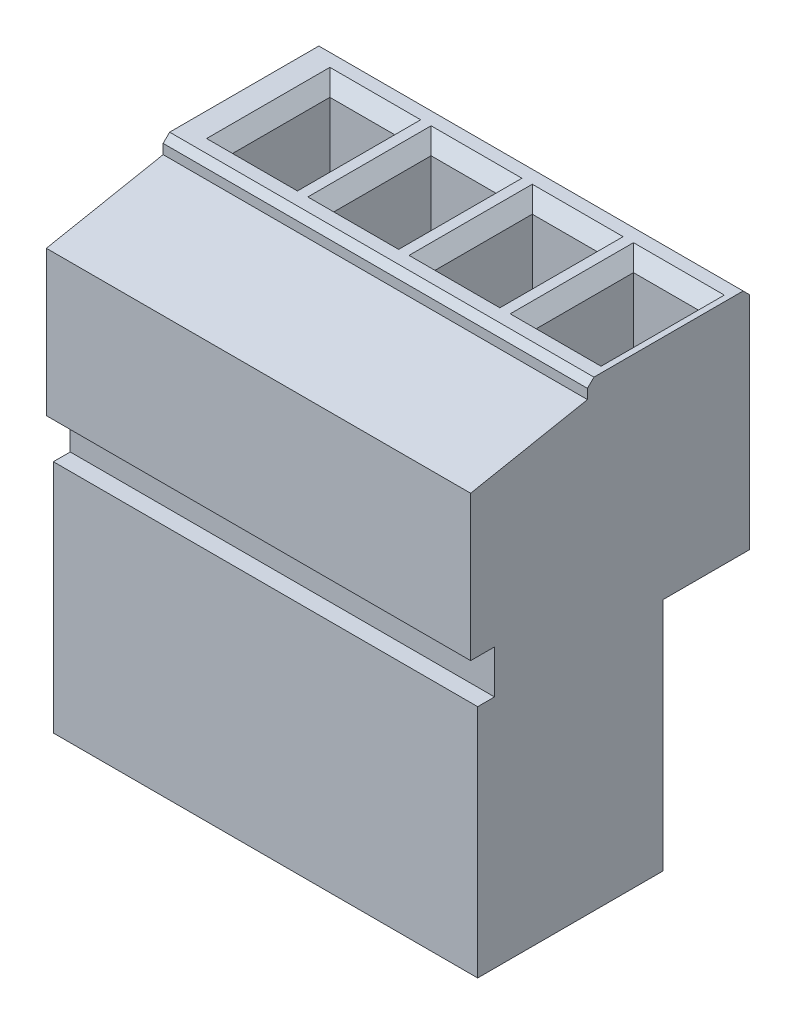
ISO-10303-21;
HEADER;
FILE_DESCRIPTION(('STEP AP214'),'2;1');
FILE_NAME('part.step','',(''),(''),'','','');
FILE_SCHEMA(('AUTOMOTIVE_DESIGN { 1 0 10303 214 1 1 1 1 }'));
ENDSEC;
DATA;
#1=APPLICATION_CONTEXT('core data for automotive mechanical design processes');
#2=APPLICATION_PROTOCOL_DEFINITION('international standard','automotive_design',2000,#1);
#3=PRODUCT_CONTEXT('',#1,'mechanical');
#4=PRODUCT('Part','Part','',(#3));
#5=PRODUCT_RELATED_PRODUCT_CATEGORY('part','',(#4));
#6=PRODUCT_DEFINITION_FORMATION('','',#4);
#7=PRODUCT_DEFINITION_CONTEXT('part definition',#1,'design');
#8=PRODUCT_DEFINITION('design','',#6,#7);
#9=PRODUCT_DEFINITION_SHAPE('','',#8);
#10=(LENGTH_UNIT() NAMED_UNIT(*) SI_UNIT(.MILLI.,.METRE.));
#11=(NAMED_UNIT(*) PLANE_ANGLE_UNIT() SI_UNIT($,.RADIAN.));
#12=(NAMED_UNIT(*) SI_UNIT($,.STERADIAN.) SOLID_ANGLE_UNIT());
#13=UNCERTAINTY_MEASURE_WITH_UNIT(LENGTH_MEASURE(1.E-05),#10,'distance_accuracy_value','');
#14=(GEOMETRIC_REPRESENTATION_CONTEXT(3) GLOBAL_UNCERTAINTY_ASSIGNED_CONTEXT((#13)) GLOBAL_UNIT_ASSIGNED_CONTEXT((#10,
#11,#12)) REPRESENTATION_CONTEXT('',''));
#15=CARTESIAN_POINT('',(0.,0.,0.));
#16=DIRECTION('',(0.,0.,1.));
#17=DIRECTION('',(1.,0.,0.));
#18=AXIS2_PLACEMENT_3D('',#15,#16,#17);
#19=CARTESIAN_POINT('',(-16.6116000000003,0.,0.));
#20=DIRECTION('',(0.,0.,1.));
#21=DIRECTION('',(1.00000000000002,0.,0.));
#22=AXIS2_PLACEMENT_3D('',#19,#20,#21);
#23=PLANE('',#22);
#24=DIRECTION('',(0.,-1.,0.));
#25=VECTOR('',#24,1.);
#26=CARTESIAN_POINT('',(0.,0.,0.));
#27=LINE('',#26,#25);
#28=CARTESIAN_POINT('',(1.66533453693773E-13,9.19988000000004,0.));
#29=VERTEX_POINT('',#28);
#30=CARTESIAN_POINT('',(0.,0.,0.));
#31=VERTEX_POINT('',#30);
#32=EDGE_CURVE('E383',#29,#31,#27,.T.);
#33=ORIENTED_EDGE('',*,*,#32,.F.);
#34=DIRECTION('',(1.00000000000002,0.,0.));
#35=VECTOR('',#34,1.);
#36=CARTESIAN_POINT('',(-16.6116000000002,9.19987999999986,0.));
#37=LINE('',#36,#35);
#38=CARTESIAN_POINT('',(-16.6116000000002,9.19987999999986,0.));
#39=VERTEX_POINT('',#38);
#40=EDGE_CURVE('E462',#39,#29,#37,.T.);
#41=ORIENTED_EDGE('',*,*,#40,.F.);
#42=DIRECTION('',(0.,-1.,0.));
#43=VECTOR('',#42,1.);
#44=CARTESIAN_POINT('',(-16.6116000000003,0.,0.));
#45=LINE('',#44,#43);
#46=CARTESIAN_POINT('',(-16.6116000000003,0.,0.));
#47=VERTEX_POINT('',#46);
#48=EDGE_CURVE('E426',#39,#47,#45,.T.);
#49=ORIENTED_EDGE('',*,*,#48,.T.);
#50=DIRECTION('',(1.00000000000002,0.,0.));
#51=VECTOR('',#50,1.);
#52=CARTESIAN_POINT('',(-16.6116000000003,0.,0.));
#53=LINE('',#52,#51);
#54=EDGE_CURVE('E461',#47,#31,#53,.T.);
#55=ORIENTED_EDGE('',*,*,#54,.T.);
#56=EDGE_LOOP('',(#33,#41,#49,#55));
#57=FACE_BOUND('',#56,.T.);
#58=ADVANCED_FACE('F33',(#57),#23,.T.);
#59=CARTESIAN_POINT('',(-16.6116000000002,9.19987999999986,0.));
#60=DIRECTION('',(0.,1.,0.));
#61=DIRECTION('',(0.,0.,1.));
#62=AXIS2_PLACEMENT_3D('',#59,#60,#61);
#63=PLANE('',#62);
#64=DIRECTION('',(0.,0.,1.));
#65=VECTOR('',#64,1.);
#66=CARTESIAN_POINT('',(1.66533453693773E-13,9.19988000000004,0.));
#67=LINE('',#66,#65);
#68=CARTESIAN_POINT('',(1.66533453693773E-13,9.19988000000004,-0.659835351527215));
#69=VERTEX_POINT('',#68);
#70=EDGE_CURVE('E423',#69,#29,#67,.T.);
#71=ORIENTED_EDGE('',*,*,#70,.F.);
#72=DIRECTION('',(1.00000000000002,0.,0.));
#73=VECTOR('',#72,1.);
#74=CARTESIAN_POINT('',(-16.6116000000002,9.19987999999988,-0.659835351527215));
#75=LINE('',#74,#73);
#76=CARTESIAN_POINT('',(-16.6116000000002,9.19987999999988,-0.659835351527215));
#77=VERTEX_POINT('',#76);
#78=EDGE_CURVE('E465',#77,#69,#75,.T.);
#79=ORIENTED_EDGE('',*,*,#78,.F.);
#80=DIRECTION('',(0.,0.,1.));
#81=VECTOR('',#80,1.);
#82=CARTESIAN_POINT('',(-16.6116000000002,9.19987999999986,0.));
#83=LINE('',#82,#81);
#84=EDGE_CURVE('E458',#77,#39,#83,.T.);
#85=ORIENTED_EDGE('',*,*,#84,.T.);
#86=ORIENTED_EDGE('',*,*,#40,.T.);
#87=EDGE_LOOP('',(#71,#79,#85,#86));
#88=FACE_BOUND('',#87,.T.);
#89=ADVANCED_FACE('F656',(#88),#63,.T.);
#90=CARTESIAN_POINT('',(-16.6116000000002,9.19987999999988,-0.659835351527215));
#91=DIRECTION('',(0.,0.,1.));
#92=DIRECTION('',(1.00000000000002,0.,0.));
#93=AXIS2_PLACEMENT_3D('',#90,#91,#92);
#94=PLANE('',#93);
#95=DIRECTION('',(0.,-1.,0.));
#96=VECTOR('',#95,1.);
#97=CARTESIAN_POINT('',(1.66533453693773E-13,9.19988000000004,-0.659835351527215));
#98=LINE('',#97,#96);
#99=CARTESIAN_POINT('',(0.,10.8972335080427,-0.659835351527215));
#100=VERTEX_POINT('',#99);
#101=EDGE_CURVE('E420',#100,#69,#98,.T.);
#102=ORIENTED_EDGE('',*,*,#101,.F.);
#103=DIRECTION('',(1.00000000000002,0.,0.));
#104=VECTOR('',#103,1.);
#105=CARTESIAN_POINT('',(-16.6116000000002,10.8972335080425,-0.659835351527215));
#106=LINE('',#105,#104);
#107=CARTESIAN_POINT('',(-16.6116000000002,10.8972335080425,-0.659835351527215));
#108=VERTEX_POINT('',#107);
#109=EDGE_CURVE('E467',#108,#100,#106,.T.);
#110=ORIENTED_EDGE('',*,*,#109,.F.);
#111=DIRECTION('',(0.,-1.,0.));
#112=VECTOR('',#111,1.);
#113=CARTESIAN_POINT('',(-16.6116000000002,9.19987999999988,-0.659835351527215));
#114=LINE('',#113,#112);
#115=EDGE_CURVE('E455',#108,#77,#114,.T.);
#116=ORIENTED_EDGE('',*,*,#115,.T.);
#117=ORIENTED_EDGE('',*,*,#78,.T.);
#118=EDGE_LOOP('',(#102,#110,#116,#117));
#119=FACE_BOUND('',#118,.T.);
#120=ADVANCED_FACE('F661',(#119),#94,.T.);
#121=CARTESIAN_POINT('',(-16.6116000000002,10.8972335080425,-0.659835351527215));
#122=DIRECTION('',(0.,-1.,0.));
#123=DIRECTION('',(0.,0.,-1.));
#124=AXIS2_PLACEMENT_3D('',#121,#122,#123);
#125=PLANE('',#124);
#126=DIRECTION('',(0.,0.,-1.));
#127=VECTOR('',#126,1.);
#128=CARTESIAN_POINT('',(0.,10.8972335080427,-0.659835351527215));
#129=LINE('',#128,#127);
#130=CARTESIAN_POINT('',(0.,10.8972335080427,0.274319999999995));
#131=VERTEX_POINT('',#130);
#132=EDGE_CURVE('E417',#131,#100,#129,.T.);
#133=ORIENTED_EDGE('',*,*,#132,.F.);
#134=DIRECTION('',(1.00000000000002,0.,0.));
#135=VECTOR('',#134,1.);
#136=CARTESIAN_POINT('',(-16.6116000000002,10.8972335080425,0.274319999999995));
#137=LINE('',#136,#135);
#138=CARTESIAN_POINT('',(-16.6116000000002,10.8972335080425,0.274319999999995));
#139=VERTEX_POINT('',#138);
#140=EDGE_CURVE('E469',#139,#131,#137,.T.);
#141=ORIENTED_EDGE('',*,*,#140,.F.);
#142=DIRECTION('',(0.,0.,-1.));
#143=VECTOR('',#142,1.);
#144=CARTESIAN_POINT('',(-16.6116000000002,10.8972335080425,-0.659835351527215));
#145=LINE('',#144,#143);
#146=EDGE_CURVE('E452',#139,#108,#145,.T.);
#147=ORIENTED_EDGE('',*,*,#146,.T.);
#148=ORIENTED_EDGE('',*,*,#109,.T.);
#149=EDGE_LOOP('',(#133,#141,#147,#148));
#150=FACE_BOUND('',#149,.T.);
#151=ADVANCED_FACE('F719',(#150),#125,.T.);
#152=CARTESIAN_POINT('',(-16.6116000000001,16.5734999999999,0.274320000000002));
#153=DIRECTION('',(0.,0.,1.));
#154=DIRECTION('',(0.,-1.,0.));
#155=AXIS2_PLACEMENT_3D('',#152,#153,#154);
#156=PLANE('',#155);
#157=DIRECTION('',(0.,-1.,0.));
#158=VECTOR('',#157,1.);
#159=CARTESIAN_POINT('',(0.,16.5735,0.274320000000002));
#160=LINE('',#159,#158);
#161=CARTESIAN_POINT('',(0.,16.5735,0.274320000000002));
#162=VERTEX_POINT('',#161);
#163=EDGE_CURVE('E414',#162,#131,#160,.T.);
#164=ORIENTED_EDGE('',*,*,#163,.F.);
#165=DIRECTION('',(1.00000000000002,0.,0.));
#166=VECTOR('',#165,1.);
#167=CARTESIAN_POINT('',(-16.6116000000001,16.5734999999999,0.274320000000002));
#168=LINE('',#167,#166);
#169=CARTESIAN_POINT('',(-16.6116000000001,16.5734999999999,0.274320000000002));
#170=VERTEX_POINT('',#169);
#171=EDGE_CURVE('E471',#170,#162,#168,.T.);
#172=ORIENTED_EDGE('',*,*,#171,.F.);
#173=DIRECTION('',(0.,-1.,0.));
#174=VECTOR('',#173,1.);
#175=CARTESIAN_POINT('',(-16.6116000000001,16.5734999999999,0.274320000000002));
#176=LINE('',#175,#174);
#177=EDGE_CURVE('E449',#170,#139,#176,.T.);
#178=ORIENTED_EDGE('',*,*,#177,.T.);
#179=ORIENTED_EDGE('',*,*,#140,.T.);
#180=EDGE_LOOP('',(#164,#172,#178,#179));
#181=FACE_BOUND('',#180,.T.);
#182=ADVANCED_FACE('F716',(#181),#156,.T.);
#183=CARTESIAN_POINT('',(-16.6116000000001,17.4624999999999,-4.29768));
#184=DIRECTION('',(0.,0.981615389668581,0.190869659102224));
#185=DIRECTION('',(0.,-0.190869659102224,0.981615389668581));
#186=AXIS2_PLACEMENT_3D('',#183,#184,#185);
#187=PLANE('',#186);
#188=DIRECTION('',(0.,-0.190869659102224,0.981615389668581));
#189=VECTOR('',#188,1.);
#190=CARTESIAN_POINT('',(1.59594559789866E-13,17.4625,-4.29768));
#191=LINE('',#190,#189);
#192=CARTESIAN_POINT('',(1.59594559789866E-13,17.4625,-4.29768));
#193=VERTEX_POINT('',#192);
#194=EDGE_CURVE('E411',#193,#162,#191,.T.);
#195=ORIENTED_EDGE('',*,*,#194,.F.);
#196=DIRECTION('',(1.00000000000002,0.,0.));
#197=VECTOR('',#196,1.);
#198=CARTESIAN_POINT('',(-16.6116000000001,17.4624999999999,-4.29768));
#199=LINE('',#198,#197);
#200=CARTESIAN_POINT('',(-16.6116000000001,17.4624999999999,-4.29768));
#201=VERTEX_POINT('',#200);
#202=EDGE_CURVE('E473',#201,#193,#199,.T.);
#203=ORIENTED_EDGE('',*,*,#202,.F.);
#204=DIRECTION('',(0.,-0.190869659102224,0.981615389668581));
#205=VECTOR('',#204,1.);
#206=CARTESIAN_POINT('',(-16.6116000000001,17.4624999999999,-4.29768));
#207=LINE('',#206,#205);
#208=EDGE_CURVE('E446',#201,#170,#207,.T.);
#209=ORIENTED_EDGE('',*,*,#208,.T.);
#210=ORIENTED_EDGE('',*,*,#171,.T.);
#211=EDGE_LOOP('',(#195,#203,#209,#210));
#212=FACE_BOUND('',#211,.T.);
#213=ADVANCED_FACE('F712',(#212),#187,.T.);
#214=CARTESIAN_POINT('',(-16.6116000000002,18.0974999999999,-4.29768));
#215=DIRECTION('',(0.,0.,1.));
#216=DIRECTION('',(1.00000000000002,0.,0.));
#217=AXIS2_PLACEMENT_3D('',#214,#215,#216);
#218=PLANE('',#217);
#219=DIRECTION('',(0.,-1.,0.));
#220=VECTOR('',#219,1.);
#221=CARTESIAN_POINT('',(0.,18.0975,-4.29768));
#222=LINE('',#221,#220);
#223=CARTESIAN_POINT('',(0.,17.8435000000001,-4.29768));
#224=VERTEX_POINT('',#223);
#225=EDGE_CURVE('E409',#224,#193,#222,.T.);
#226=ORIENTED_EDGE('',*,*,#225,.F.);
#227=DIRECTION('',(-1.00000000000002,0.,0.));
#228=VECTOR('',#227,1.);
#229=CARTESIAN_POINT('',(-16.6116000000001,17.8434999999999,-4.29768));
#230=LINE('',#229,#228);
#231=CARTESIAN_POINT('',(-16.6116000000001,17.8434999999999,-4.29768));
#232=VERTEX_POINT('',#231);
#233=EDGE_CURVE('E516',#224,#232,#230,.T.);
#234=ORIENTED_EDGE('',*,*,#233,.T.);
#235=DIRECTION('',(0.,-1.,0.));
#236=VECTOR('',#235,1.);
#237=CARTESIAN_POINT('',(-16.6116000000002,18.0974999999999,-4.29768));
#238=LINE('',#237,#236);
#239=EDGE_CURVE('E444',#232,#201,#238,.T.);
#240=ORIENTED_EDGE('',*,*,#239,.T.);
#241=ORIENTED_EDGE('',*,*,#202,.T.);
#242=EDGE_LOOP('',(#226,#234,#240,#241));
#243=FACE_BOUND('',#242,.T.);
#244=ADVANCED_FACE('F707',(#243),#218,.T.);
#245=CARTESIAN_POINT('',(-16.6116000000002,18.0974999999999,-4.29768));
#246=DIRECTION('',(0.,1.,0.));
#247=DIRECTION('',(0.,0.,1.));
#248=AXIS2_PLACEMENT_3D('',#245,#246,#247);
#249=PLANE('',#248);
#250=DIRECTION('',(-1.00000000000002,0.,0.));
#251=VECTOR('',#250,1.);
#252=CARTESIAN_POINT('',(-15.1638000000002,18.0974999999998,-5.05968));
#253=LINE('',#252,#251);
#254=CARTESIAN_POINT('',(-12.1158000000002,18.0975000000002,-5.05968));
#255=VERTEX_POINT('',#254);
#256=CARTESIAN_POINT('',(-15.6718000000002,18.0975,-5.05968));
#257=VERTEX_POINT('',#256);
#258=EDGE_CURVE('E557',#255,#257,#253,.T.);
#259=ORIENTED_EDGE('',*,*,#258,.T.);
#260=DIRECTION('',(0.,0.,-1.));
#261=VECTOR('',#260,1.);
#262=CARTESIAN_POINT('',(-15.6718000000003,18.0975,-9.37768));
#263=LINE('',#262,#261);
#264=CARTESIAN_POINT('',(-15.6718000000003,18.0975,-9.88568000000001));
#265=VERTEX_POINT('',#264);
#266=EDGE_CURVE('E563',#257,#265,#263,.T.);
#267=ORIENTED_EDGE('',*,*,#266,.T.);
#268=DIRECTION('',(1.00000000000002,0.,0.));
#269=VECTOR('',#268,1.);
#270=CARTESIAN_POINT('',(-12.6238000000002,18.0975,-9.88568000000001));
#271=LINE('',#270,#269);
#272=CARTESIAN_POINT('',(-12.1158000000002,18.0975000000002,-9.88568000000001));
#273=VERTEX_POINT('',#272);
#274=EDGE_CURVE('E561',#265,#273,#271,.T.);
#275=ORIENTED_EDGE('',*,*,#274,.T.);
#276=DIRECTION('',(0.,0.,1.));
#277=VECTOR('',#276,1.);
#278=CARTESIAN_POINT('',(-12.1158000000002,18.0975000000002,-5.56767999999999));
#279=LINE('',#278,#277);
#280=EDGE_CURVE('E559',#273,#255,#279,.T.);
#281=ORIENTED_EDGE('',*,*,#280,.T.);
#282=EDGE_LOOP('',(#259,#267,#275,#281));
#283=FACE_BOUND('',#282,.T.);
#284=DIRECTION('',(-1.00000000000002,0.,0.));
#285=VECTOR('',#284,1.);
#286=CARTESIAN_POINT('',(-11.2014000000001,18.0974999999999,-5.05968));
#287=LINE('',#286,#285);
#288=CARTESIAN_POINT('',(-8.15340000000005,18.0974999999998,-5.05968));
#289=VERTEX_POINT('',#288);
#290=CARTESIAN_POINT('',(-11.7094000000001,18.0974999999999,-5.05968));
#291=VERTEX_POINT('',#290);
#292=EDGE_CURVE('E539',#289,#291,#287,.T.);
#293=ORIENTED_EDGE('',*,*,#292,.T.);
#294=DIRECTION('',(0.,0.,-1.));
#295=VECTOR('',#294,1.);
#296=CARTESIAN_POINT('',(-11.7094000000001,18.0974999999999,-9.37768));
#297=LINE('',#296,#295);
#298=CARTESIAN_POINT('',(-11.7094000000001,18.0974999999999,-9.88568000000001));
#299=VERTEX_POINT('',#298);
#300=EDGE_CURVE('E545',#291,#299,#297,.T.);
#301=ORIENTED_EDGE('',*,*,#300,.T.);
#302=DIRECTION('',(1.00000000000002,0.,0.));
#303=VECTOR('',#302,1.);
#304=CARTESIAN_POINT('',(-8.66140000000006,18.0975,-9.88568000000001));
#305=LINE('',#304,#303);
#306=CARTESIAN_POINT('',(-8.15340000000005,18.0974999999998,-9.88568000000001));
#307=VERTEX_POINT('',#306);
#308=EDGE_CURVE('E543',#299,#307,#305,.T.);
#309=ORIENTED_EDGE('',*,*,#308,.T.);
#310=DIRECTION('',(0.,0.,1.));
#311=VECTOR('',#310,1.);
#312=CARTESIAN_POINT('',(-8.15340000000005,18.0974999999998,-5.56767999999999));
#313=LINE('',#312,#311);
#314=EDGE_CURVE('E541',#307,#289,#313,.T.);
#315=ORIENTED_EDGE('',*,*,#314,.T.);
#316=EDGE_LOOP('',(#293,#301,#309,#315));
#317=FACE_BOUND('',#316,.T.);
#318=DIRECTION('',(-1.00000000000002,0.,0.));
#319=VECTOR('',#318,1.);
#320=CARTESIAN_POINT('',(-7.23900000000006,18.0975,-5.05968));
#321=LINE('',#320,#319);
#322=CARTESIAN_POINT('',(-4.19100000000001,18.0975,-5.05968));
#323=VERTEX_POINT('',#322);
#324=CARTESIAN_POINT('',(-7.74700000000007,18.0975000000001,-5.05968));
#325=VERTEX_POINT('',#324);
#326=EDGE_CURVE('E521',#323,#325,#321,.T.);
#327=ORIENTED_EDGE('',*,*,#326,.T.);
#328=DIRECTION('',(0.,0.,-1.));
#329=VECTOR('',#328,1.);
#330=CARTESIAN_POINT('',(-7.74700000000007,18.0975000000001,-9.37768));
#331=LINE('',#330,#329);
#332=CARTESIAN_POINT('',(-7.74700000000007,18.0975000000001,-9.88568000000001));
#333=VERTEX_POINT('',#332);
#334=EDGE_CURVE('E527',#325,#333,#331,.T.);
#335=ORIENTED_EDGE('',*,*,#334,.T.);
#336=DIRECTION('',(1.00000000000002,0.,0.));
#337=VECTOR('',#336,1.);
#338=CARTESIAN_POINT('',(-4.69900000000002,18.0974999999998,-9.88568000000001));
#339=LINE('',#338,#337);
#340=CARTESIAN_POINT('',(-4.19100000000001,18.0975,-9.88568000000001));
#341=VERTEX_POINT('',#340);
#342=EDGE_CURVE('E525',#333,#341,#339,.T.);
#343=ORIENTED_EDGE('',*,*,#342,.T.);
#344=DIRECTION('',(0.,0.,1.));
#345=VECTOR('',#344,1.);
#346=CARTESIAN_POINT('',(-4.19100000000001,18.0975,-5.56767999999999));
#347=LINE('',#346,#345);
#348=EDGE_CURVE('E523',#341,#323,#347,.T.);
#349=ORIENTED_EDGE('',*,*,#348,.T.);
#350=EDGE_LOOP('',(#327,#335,#343,#349));
#351=FACE_BOUND('',#350,.T.);
#352=DIRECTION('',(-1.00000000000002,0.,0.));
#353=VECTOR('',#352,1.);
#354=CARTESIAN_POINT('',(-3.27660000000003,18.0975,-5.05968));
#355=LINE('',#354,#353);
#356=CARTESIAN_POINT('',(-0.228600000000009,18.0975,-5.05968));
#357=VERTEX_POINT('',#356);
#358=CARTESIAN_POINT('',(-3.78460000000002,18.0975,-5.05968));
#359=VERTEX_POINT('',#358);
#360=EDGE_CURVE('E485',#357,#359,#355,.T.);
#361=ORIENTED_EDGE('',*,*,#360,.T.);
#362=DIRECTION('',(0.,0.,-1.));
#363=VECTOR('',#362,1.);
#364=CARTESIAN_POINT('',(-3.78460000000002,18.0975,-9.37768));
#365=LINE('',#364,#363);
#366=CARTESIAN_POINT('',(-3.78460000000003,18.0975,-9.88568000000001));
#367=VERTEX_POINT('',#366);
#368=EDGE_CURVE('E491',#359,#367,#365,.T.);
#369=ORIENTED_EDGE('',*,*,#368,.T.);
#370=DIRECTION('',(1.00000000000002,0.,0.));
#371=VECTOR('',#370,1.);
#372=CARTESIAN_POINT('',(-0.736600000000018,18.0975000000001,-9.88568000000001));
#373=LINE('',#372,#371);
#374=CARTESIAN_POINT('',(-0.228600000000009,18.0975,-9.88568000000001));
#375=VERTEX_POINT('',#374);
#376=EDGE_CURVE('E489',#367,#375,#373,.T.);
#377=ORIENTED_EDGE('',*,*,#376,.T.);
#378=DIRECTION('',(0.,0.,1.));
#379=VECTOR('',#378,1.);
#380=CARTESIAN_POINT('',(-0.228600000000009,18.0975,-5.56767999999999));
#381=LINE('',#380,#379);
#382=EDGE_CURVE('E487',#375,#357,#381,.T.);
#383=ORIENTED_EDGE('',*,*,#382,.T.);
#384=EDGE_LOOP('',(#361,#369,#377,#383));
#385=FACE_BOUND('',#384,.T.);
#386=DIRECTION('',(0.,0.,1.));
#387=VECTOR('',#386,1.);
#388=CARTESIAN_POINT('',(0.,18.0975,-4.29768));
#389=LINE('',#388,#387);
#390=CARTESIAN_POINT('',(0.,18.0975000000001,-10.39368));
#391=VERTEX_POINT('',#390);
#392=CARTESIAN_POINT('',(0.,18.0975,-4.55168));
#393=VERTEX_POINT('',#392);
#394=EDGE_CURVE('E406',#391,#393,#389,.T.);
#395=ORIENTED_EDGE('',*,*,#394,.F.);
#396=DIRECTION('',(-1.00000000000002,0.,0.));
#397=VECTOR('',#396,1.);
#398=CARTESIAN_POINT('',(-16.6116000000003,18.0974999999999,-10.39368));
#399=LINE('',#398,#397);
#400=CARTESIAN_POINT('',(-16.6116000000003,18.0974999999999,-10.39368));
#401=VERTEX_POINT('',#400);
#402=EDGE_CURVE('E510',#391,#401,#399,.T.);
#403=ORIENTED_EDGE('',*,*,#402,.T.);
#404=DIRECTION('',(0.,0.,1.));
#405=VECTOR('',#404,1.);
#406=CARTESIAN_POINT('',(-16.6116000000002,18.0974999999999,-4.29768));
#407=LINE('',#406,#405);
#408=CARTESIAN_POINT('',(-16.6116000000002,18.0974999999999,-4.55168));
#409=VERTEX_POINT('',#408);
#410=EDGE_CURVE('E441',#401,#409,#407,.T.);
#411=ORIENTED_EDGE('',*,*,#410,.T.);
#412=DIRECTION('',(1.00000000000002,0.,0.));
#413=VECTOR('',#412,1.);
#414=CARTESIAN_POINT('',(-16.6116000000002,18.0974999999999,-4.55168));
#415=LINE('',#414,#413);
#416=EDGE_CURVE('E507',#409,#393,#415,.T.);
#417=ORIENTED_EDGE('',*,*,#416,.T.);
#418=EDGE_LOOP('',(#395,#403,#411,#417));
#419=FACE_BOUND('',#418,.T.);
#420=ADVANCED_FACE('F643',(#283,#317,#351,#385,#419),#249,.T.);
#421=CARTESIAN_POINT('',(-16.6116000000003,18.0974999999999,-10.64768));
#422=DIRECTION('',(0.,0.,-1.));
#423=DIRECTION('',(0.,1.,0.));
#424=AXIS2_PLACEMENT_3D('',#421,#422,#423);
#425=PLANE('',#424);
#426=DIRECTION('',(0.,1.,0.));
#427=VECTOR('',#426,1.);
#428=CARTESIAN_POINT('',(-16.6116000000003,18.0974999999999,-10.64768));
#429=LINE('',#428,#427);
#430=CARTESIAN_POINT('',(-16.6116000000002,9.19987999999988,-10.64768));
#431=VERTEX_POINT('',#430);
#432=CARTESIAN_POINT('',(-16.6116000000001,17.8434999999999,-10.64768));
#433=VERTEX_POINT('',#432);
#434=EDGE_CURVE('E438',#431,#433,#429,.T.);
#435=ORIENTED_EDGE('',*,*,#434,.T.);
#436=DIRECTION('',(1.00000000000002,0.,0.));
#437=VECTOR('',#436,1.);
#438=CARTESIAN_POINT('',(-16.6116000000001,17.8434999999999,-10.64768));
#439=LINE('',#438,#437);
#440=CARTESIAN_POINT('',(0.,17.8435000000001,-10.64768));
#441=VERTEX_POINT('',#440);
#442=EDGE_CURVE('E500',#433,#441,#439,.T.);
#443=ORIENTED_EDGE('',*,*,#442,.T.);
#444=DIRECTION('',(0.,1.,0.));
#445=VECTOR('',#444,1.);
#446=CARTESIAN_POINT('',(0.,18.0975000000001,-10.64768));
#447=LINE('',#446,#445);
#448=CARTESIAN_POINT('',(1.66533453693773E-13,9.19988000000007,-10.64768));
#449=VERTEX_POINT('',#448);
#450=EDGE_CURVE('E403',#449,#441,#447,.T.);
#451=ORIENTED_EDGE('',*,*,#450,.F.);
#452=DIRECTION('',(1.00000000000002,0.,0.));
#453=VECTOR('',#452,1.);
#454=CARTESIAN_POINT('',(-16.6116000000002,9.19987999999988,-10.64768));
#455=LINE('',#454,#453);
#456=EDGE_CURVE('E476',#431,#449,#455,.T.);
#457=ORIENTED_EDGE('',*,*,#456,.F.);
#458=EDGE_LOOP('',(#435,#443,#451,#457));
#459=FACE_BOUND('',#458,.T.);
#460=ADVANCED_FACE('F691',(#459),#425,.T.);
#461=CARTESIAN_POINT('',(-16.6116000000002,9.19987999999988,-7.24915999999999));
#462=DIRECTION('',(0.,-1.,0.));
#463=DIRECTION('',(0.,0.,-1.));
#464=AXIS2_PLACEMENT_3D('',#461,#462,#463);
#465=PLANE('',#464);
#466=DIRECTION('',(0.,0.,-1.));
#467=VECTOR('',#466,1.);
#468=CARTESIAN_POINT('',(1.66533453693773E-13,9.19988000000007,-7.24915999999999));
#469=LINE('',#468,#467);
#470=CARTESIAN_POINT('',(1.66533453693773E-13,9.19988000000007,-7.24915999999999));
#471=VERTEX_POINT('',#470);
#472=EDGE_CURVE('E400',#471,#449,#469,.T.);
#473=ORIENTED_EDGE('',*,*,#472,.F.);
#474=DIRECTION('',(1.00000000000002,0.,0.));
#475=VECTOR('',#474,1.);
#476=CARTESIAN_POINT('',(-16.6116000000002,9.19987999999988,-7.24915999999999));
#477=LINE('',#476,#475);
#478=CARTESIAN_POINT('',(-16.6116000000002,9.19987999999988,-7.24915999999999));
#479=VERTEX_POINT('',#478);
#480=EDGE_CURVE('E478',#479,#471,#477,.T.);
#481=ORIENTED_EDGE('',*,*,#480,.F.);
#482=DIRECTION('',(0.,0.,-1.));
#483=VECTOR('',#482,1.);
#484=CARTESIAN_POINT('',(-16.6116000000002,9.19987999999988,-7.24915999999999));
#485=LINE('',#484,#483);
#486=EDGE_CURVE('E435',#479,#431,#485,.T.);
#487=ORIENTED_EDGE('',*,*,#486,.T.);
#488=ORIENTED_EDGE('',*,*,#456,.T.);
#489=EDGE_LOOP('',(#473,#481,#487,#488));
#490=FACE_BOUND('',#489,.T.);
#491=ADVANCED_FACE('F687',(#490),#465,.T.);
#492=CARTESIAN_POINT('',(-16.6116000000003,0.,-7.24916));
#493=DIRECTION('',(0.,0.,-1.));
#494=DIRECTION('',(-1.00000000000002,0.,0.));
#495=AXIS2_PLACEMENT_3D('',#492,#493,#494);
#496=PLANE('',#495);
#497=DIRECTION('',(0.,1.,0.));
#498=VECTOR('',#497,1.);
#499=CARTESIAN_POINT('',(0.,0.,-7.24916));
#500=LINE('',#499,#498);
#501=CARTESIAN_POINT('',(0.,0.,-7.24916));
#502=VERTEX_POINT('',#501);
#503=EDGE_CURVE('E397',#502,#471,#500,.T.);
#504=ORIENTED_EDGE('',*,*,#503,.F.);
#505=DIRECTION('',(1.00000000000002,0.,0.));
#506=VECTOR('',#505,1.);
#507=CARTESIAN_POINT('',(-16.6116000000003,0.,-7.24916));
#508=LINE('',#507,#506);
#509=CARTESIAN_POINT('',(-16.6116000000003,0.,-7.24916));
#510=VERTEX_POINT('',#509);
#511=EDGE_CURVE('E480',#510,#502,#508,.T.);
#512=ORIENTED_EDGE('',*,*,#511,.F.);
#513=DIRECTION('',(0.,1.,0.));
#514=VECTOR('',#513,1.);
#515=CARTESIAN_POINT('',(-16.6116000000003,0.,-7.24916));
#516=LINE('',#515,#514);
#517=EDGE_CURVE('E432',#510,#479,#516,.T.);
#518=ORIENTED_EDGE('',*,*,#517,.T.);
#519=ORIENTED_EDGE('',*,*,#480,.T.);
#520=EDGE_LOOP('',(#504,#512,#518,#519));
#521=FACE_BOUND('',#520,.T.);
#522=ADVANCED_FACE('F685',(#521),#496,.T.);
#523=CARTESIAN_POINT('',(-16.6116000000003,0.,0.));
#524=DIRECTION('',(0.,-1.,0.));
#525=DIRECTION('',(0.,0.,-1.));
#526=AXIS2_PLACEMENT_3D('',#523,#524,#525);
#527=PLANE('',#526);
#528=DIRECTION('',(0.,0.,-1.));
#529=VECTOR('',#528,1.);
#530=CARTESIAN_POINT('',(0.,0.,0.));
#531=LINE('',#530,#529);
#532=EDGE_CURVE('E394',#31,#502,#531,.T.);
#533=ORIENTED_EDGE('',*,*,#532,.F.);
#534=ORIENTED_EDGE('',*,*,#54,.F.);
#535=DIRECTION('',(0.,0.,-1.));
#536=VECTOR('',#535,1.);
#537=CARTESIAN_POINT('',(-16.6116000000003,0.,0.));
#538=LINE('',#537,#536);
#539=EDGE_CURVE('E429',#47,#510,#538,.T.);
#540=ORIENTED_EDGE('',*,*,#539,.T.);
#541=ORIENTED_EDGE('',*,*,#511,.T.);
#542=EDGE_LOOP('',(#533,#534,#540,#541));
#543=FACE_BOUND('',#542,.T.);
#544=ADVANCED_FACE('F681',(#543),#527,.T.);
#545=CARTESIAN_POINT('',(-16.6116000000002,9.19987999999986,0.));
#546=DIRECTION('',(-1.00000000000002,0.,0.));
#547=DIRECTION('',(0.,0.,1.));
#548=AXIS2_PLACEMENT_3D('',#545,#546,#547);
#549=PLANE('',#548);
#550=ORIENTED_EDGE('',*,*,#410,.F.);
#551=DIRECTION('',(0.,0.707106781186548,0.707106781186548));
#552=VECTOR('',#551,1.);
#553=CARTESIAN_POINT('',(-16.6116000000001,18.8455299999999,-9.64565000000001));
#554=LINE('',#553,#552);
#555=EDGE_CURVE('E514',#401,#433,#554,.F.);
#556=ORIENTED_EDGE('',*,*,#555,.T.);
#557=ORIENTED_EDGE('',*,*,#434,.F.);
#558=ORIENTED_EDGE('',*,*,#486,.F.);
#559=ORIENTED_EDGE('',*,*,#517,.F.);
#560=ORIENTED_EDGE('',*,*,#539,.F.);
#561=ORIENTED_EDGE('',*,*,#48,.F.);
#562=ORIENTED_EDGE('',*,*,#84,.F.);
#563=ORIENTED_EDGE('',*,*,#115,.F.);
#564=ORIENTED_EDGE('',*,*,#146,.F.);
#565=ORIENTED_EDGE('',*,*,#177,.F.);
#566=ORIENTED_EDGE('',*,*,#208,.F.);
#567=ORIENTED_EDGE('',*,*,#239,.F.);
#568=DIRECTION('',(0.,-0.707106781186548,0.707106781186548));
#569=VECTOR('',#568,1.);
#570=CARTESIAN_POINT('',(-16.6116000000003,11.3728499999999,2.17297));
#571=LINE('',#570,#569);
#572=EDGE_CURVE('E512',#232,#409,#571,.F.);
#573=ORIENTED_EDGE('',*,*,#572,.T.);
#574=EDGE_LOOP('',(#550,#556,#557,#558,#559,#560,#561,#562,#563,#564,#565,#566,#567,#573));
#575=FACE_BOUND('',#574,.T.);
#576=ADVANCED_FACE('F675',(#575),#549,.T.);
#577=CARTESIAN_POINT('',(1.66533453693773E-13,9.19988000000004,0.));
#578=DIRECTION('',(-1.00000000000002,0.,0.));
#579=DIRECTION('',(0.,0.,1.));
#580=AXIS2_PLACEMENT_3D('',#577,#578,#579);
#581=PLANE('',#580);
#582=ORIENTED_EDGE('',*,*,#450,.T.);
#583=DIRECTION('',(0.,-0.707106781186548,-0.707106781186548));
#584=VECTOR('',#583,1.);
#585=CARTESIAN_POINT('',(0.,17.8435000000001,-10.64768));
#586=LINE('',#585,#584);
#587=EDGE_CURVE('E505',#441,#391,#586,.F.);
#588=ORIENTED_EDGE('',*,*,#587,.T.);
#589=ORIENTED_EDGE('',*,*,#394,.T.);
#590=DIRECTION('',(0.,0.707106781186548,-0.707106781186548));
#591=VECTOR('',#590,1.);
#592=CARTESIAN_POINT('',(0.,18.0975,-4.55168));
#593=LINE('',#592,#591);
#594=EDGE_CURVE('E503',#393,#224,#593,.F.);
#595=ORIENTED_EDGE('',*,*,#594,.T.);
#596=ORIENTED_EDGE('',*,*,#225,.T.);
#597=ORIENTED_EDGE('',*,*,#194,.T.);
#598=ORIENTED_EDGE('',*,*,#163,.T.);
#599=ORIENTED_EDGE('',*,*,#132,.T.);
#600=ORIENTED_EDGE('',*,*,#101,.T.);
#601=ORIENTED_EDGE('',*,*,#70,.T.);
#602=ORIENTED_EDGE('',*,*,#32,.T.);
#603=ORIENTED_EDGE('',*,*,#532,.T.);
#604=ORIENTED_EDGE('',*,*,#503,.T.);
#605=ORIENTED_EDGE('',*,*,#472,.T.);
#606=EDGE_LOOP('',(#582,#588,#589,#595,#596,#597,#598,#599,#600,#601,#602,#603,#604,#605));
#607=FACE_BOUND('',#606,.T.);
#608=ADVANCED_FACE('F669',(#607),#581,.F.);
#609=CARTESIAN_POINT('',(-0.736600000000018,14.2875000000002,-5.56767999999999));
#610=DIRECTION('',(1.00000000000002,0.,0.));
#611=DIRECTION('',(0.,0.,-1.));
#612=AXIS2_PLACEMENT_3D('',#609,#610,#611);
#613=PLANE('',#612);
#614=DIRECTION('',(0.,1.,0.));
#615=VECTOR('',#614,1.);
#616=CARTESIAN_POINT('',(-0.736600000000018,14.2875000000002,-5.56767999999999));
#617=LINE('',#616,#615);
#618=CARTESIAN_POINT('',(-0.736600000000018,14.2875000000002,-5.56767999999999));
#619=VERTEX_POINT('',#618);
#620=CARTESIAN_POINT('',(-0.736599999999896,17.5895000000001,-5.56767999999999));
#621=VERTEX_POINT('',#620);
#622=EDGE_CURVE('E380',#619,#621,#617,.T.);
#623=ORIENTED_EDGE('',*,*,#622,.T.);
#624=DIRECTION('',(0.,0.,-1.));
#625=VECTOR('',#624,1.);
#626=CARTESIAN_POINT('',(-0.736599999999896,17.5895000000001,-9.37768));
#627=LINE('',#626,#625);
#628=CARTESIAN_POINT('',(-0.736599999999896,17.5895000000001,-9.37768));
#629=VERTEX_POINT('',#628);
#630=EDGE_CURVE('E496',#621,#629,#627,.T.);
#631=ORIENTED_EDGE('',*,*,#630,.T.);
#632=DIRECTION('',(0.,1.,0.));
#633=VECTOR('',#632,1.);
#634=CARTESIAN_POINT('',(-0.736600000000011,14.2875000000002,-9.37768));
#635=LINE('',#634,#633);
#636=CARTESIAN_POINT('',(-0.736600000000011,14.2875000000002,-9.37768));
#637=VERTEX_POINT('',#636);
#638=EDGE_CURVE('E379',#637,#629,#635,.T.);
#639=ORIENTED_EDGE('',*,*,#638,.F.);
#640=DIRECTION('',(0.,0.,-1.));
#641=VECTOR('',#640,1.);
#642=CARTESIAN_POINT('',(-0.736600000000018,14.2875000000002,-5.56767999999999));
#643=LINE('',#642,#641);
#644=EDGE_CURVE('E367',#619,#637,#643,.T.);
#645=ORIENTED_EDGE('',*,*,#644,.F.);
#646=EDGE_LOOP('',(#623,#631,#639,#645));
#647=FACE_BOUND('',#646,.T.);
#648=ADVANCED_FACE('F750',(#647),#613,.F.);
#649=CARTESIAN_POINT('',(-0.736600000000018,14.2875000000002,-5.56767999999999));
#650=DIRECTION('',(0.,0.,1.));
#651=DIRECTION('',(1.00000000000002,0.,0.));
#652=AXIS2_PLACEMENT_3D('',#649,#650,#651);
#653=PLANE('',#652);
#654=DIRECTION('',(0.,1.,0.));
#655=VECTOR('',#654,1.);
#656=CARTESIAN_POINT('',(-3.27660000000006,14.2875,-5.56767999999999));
#657=LINE('',#656,#655);
#658=CARTESIAN_POINT('',(-3.27660000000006,14.2875,-5.56767999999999));
#659=VERTEX_POINT('',#658);
#660=CARTESIAN_POINT('',(-3.2766,17.5895,-5.56767999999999));
#661=VERTEX_POINT('',#660);
#662=EDGE_CURVE('E384',#659,#661,#657,.T.);
#663=ORIENTED_EDGE('',*,*,#662,.T.);
#664=DIRECTION('',(1.00000000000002,0.,0.));
#665=VECTOR('',#664,1.);
#666=CARTESIAN_POINT('',(-0.736599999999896,17.5895000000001,-5.56767999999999));
#667=LINE('',#666,#665);
#668=EDGE_CURVE('E498',#661,#621,#667,.T.);
#669=ORIENTED_EDGE('',*,*,#668,.T.);
#670=ORIENTED_EDGE('',*,*,#622,.F.);
#671=DIRECTION('',(1.00000000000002,0.,0.));
#672=VECTOR('',#671,1.);
#673=CARTESIAN_POINT('',(-0.736600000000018,14.2875000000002,-5.56767999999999));
#674=LINE('',#673,#672);
#675=EDGE_CURVE('E376',#659,#619,#674,.T.);
#676=ORIENTED_EDGE('',*,*,#675,.F.);
#677=EDGE_LOOP('',(#663,#669,#670,#676));
#678=FACE_BOUND('',#677,.T.);
#679=ADVANCED_FACE('F755',(#678),#653,.F.);
#680=CARTESIAN_POINT('',(-3.27660000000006,14.2875,-5.56767999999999));
#681=DIRECTION('',(-1.00000000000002,0.,0.));
#682=DIRECTION('',(0.,0.,1.));
#683=AXIS2_PLACEMENT_3D('',#680,#681,#682);
#684=PLANE('',#683);
#685=DIRECTION('',(0.,1.,0.));
#686=VECTOR('',#685,1.);
#687=CARTESIAN_POINT('',(-3.27660000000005,14.2875,-9.37768));
#688=LINE('',#687,#686);
#689=CARTESIAN_POINT('',(-3.27660000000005,14.2875,-9.37768));
#690=VERTEX_POINT('',#689);
#691=CARTESIAN_POINT('',(-3.2766,17.5895,-9.37768));
#692=VERTEX_POINT('',#691);
#693=EDGE_CURVE('E387',#690,#692,#688,.T.);
#694=ORIENTED_EDGE('',*,*,#693,.T.);
#695=DIRECTION('',(0.,0.,1.));
#696=VECTOR('',#695,1.);
#697=CARTESIAN_POINT('',(-3.2766,17.5895,-5.56767999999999));
#698=LINE('',#697,#696);
#699=EDGE_CURVE('E464',#692,#661,#698,.T.);
#700=ORIENTED_EDGE('',*,*,#699,.T.);
#701=ORIENTED_EDGE('',*,*,#662,.F.);
#702=DIRECTION('',(0.,0.,1.));
#703=VECTOR('',#702,1.);
#704=CARTESIAN_POINT('',(-3.27660000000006,14.2875,-5.56767999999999));
#705=LINE('',#704,#703);
#706=EDGE_CURVE('E373',#690,#659,#705,.T.);
#707=ORIENTED_EDGE('',*,*,#706,.F.);
#708=EDGE_LOOP('',(#694,#700,#701,#707));
#709=FACE_BOUND('',#708,.T.);
#710=ADVANCED_FACE('F761',(#709),#684,.F.);
#711=CARTESIAN_POINT('',(-0.736600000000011,14.2875000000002,-9.37768));
#712=DIRECTION('',(0.,0.,-1.));
#713=DIRECTION('',(-1.00000000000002,0.,0.));
#714=AXIS2_PLACEMENT_3D('',#711,#712,#713);
#715=PLANE('',#714);
#716=ORIENTED_EDGE('',*,*,#638,.T.);
#717=DIRECTION('',(-1.00000000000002,0.,0.));
#718=VECTOR('',#717,1.);
#719=CARTESIAN_POINT('',(-3.2766,17.5895,-9.37768));
#720=LINE('',#719,#718);
#721=EDGE_CURVE('E494',#629,#692,#720,.T.);
#722=ORIENTED_EDGE('',*,*,#721,.T.);
#723=ORIENTED_EDGE('',*,*,#693,.F.);
#724=DIRECTION('',(-1.00000000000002,0.,0.));
#725=VECTOR('',#724,1.);
#726=CARTESIAN_POINT('',(-0.736600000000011,14.2875000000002,-9.37768));
#727=LINE('',#726,#725);
#728=EDGE_CURVE('E370',#637,#690,#727,.T.);
#729=ORIENTED_EDGE('',*,*,#728,.F.);
#730=EDGE_LOOP('',(#716,#722,#723,#729));
#731=FACE_BOUND('',#730,.T.);
#732=ADVANCED_FACE('F757',(#731),#715,.F.);
#733=CARTESIAN_POINT('',(-0.736600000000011,14.2875000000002,-9.37768));
#734=DIRECTION('',(0.,1.,0.));
#735=DIRECTION('',(0.,0.,1.));
#736=AXIS2_PLACEMENT_3D('',#733,#734,#735);
#737=PLANE('',#736);
#738=ORIENTED_EDGE('',*,*,#644,.T.);
#739=ORIENTED_EDGE('',*,*,#728,.T.);
#740=ORIENTED_EDGE('',*,*,#706,.T.);
#741=ORIENTED_EDGE('',*,*,#675,.T.);
#742=EDGE_LOOP('',(#738,#739,#740,#741));
#743=FACE_BOUND('',#742,.T.);
#744=ADVANCED_FACE('F760',(#743),#737,.T.);
#745=CARTESIAN_POINT('',(-0.736599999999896,17.5895000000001,-5.56767999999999));
#746=DIRECTION('',(-0.707106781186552,0.707106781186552,0.));
#747=DIRECTION('',(-0.707106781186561,-0.707106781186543,0.));
#748=AXIS2_PLACEMENT_3D('',#745,#746,#747);
#749=PLANE('',#748);
#750=DIRECTION('',(-0.577350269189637,-0.577350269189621,-0.577350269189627));
#751=VECTOR('',#750,1.);
#752=CARTESIAN_POINT('',(-0.736599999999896,17.5895000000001,-5.56767999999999));
#753=LINE('',#752,#751);
#754=EDGE_CURVE('E361',#357,#621,#753,.T.);
#755=ORIENTED_EDGE('',*,*,#754,.F.);
#756=ORIENTED_EDGE('',*,*,#382,.F.);
#757=DIRECTION('',(-0.577350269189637,-0.577350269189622,0.577350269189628));
#758=VECTOR('',#757,1.);
#759=CARTESIAN_POINT('',(-0.736599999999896,17.5895000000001,-9.37768));
#760=LINE('',#759,#758);
#761=EDGE_CURVE('E364',#629,#375,#760,.F.);
#762=ORIENTED_EDGE('',*,*,#761,.F.);
#763=ORIENTED_EDGE('',*,*,#630,.F.);
#764=EDGE_LOOP('',(#755,#756,#762,#763));
#765=FACE_BOUND('',#764,.T.);
#766=ADVANCED_FACE('F771',(#765),#749,.T.);
#767=CARTESIAN_POINT('',(-0.736599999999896,17.5895000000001,-9.37768));
#768=DIRECTION('',(0.,0.707106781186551,0.707106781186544));
#769=DIRECTION('',(0.,-0.707106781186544,0.707106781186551));
#770=AXIS2_PLACEMENT_3D('',#767,#768,#769);
#771=PLANE('',#770);
#772=ORIENTED_EDGE('',*,*,#761,.T.);
#773=ORIENTED_EDGE('',*,*,#376,.F.);
#774=DIRECTION('',(0.577350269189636,-0.577350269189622,0.577350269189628));
#775=VECTOR('',#774,1.);
#776=CARTESIAN_POINT('',(-2.0066,16.3195000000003,-8.10767999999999));
#777=LINE('',#776,#775);
#778=EDGE_CURVE('E359',#692,#367,#777,.F.);
#779=ORIENTED_EDGE('',*,*,#778,.F.);
#780=ORIENTED_EDGE('',*,*,#721,.F.);
#781=EDGE_LOOP('',(#772,#773,#779,#780));
#782=FACE_BOUND('',#781,.T.);
#783=ADVANCED_FACE('F775',(#782),#771,.T.);
#784=CARTESIAN_POINT('',(-0.736599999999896,17.5895000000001,-5.56767999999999));
#785=DIRECTION('',(0.,0.707106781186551,-0.707106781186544));
#786=DIRECTION('',(0.,0.707106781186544,0.707106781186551));
#787=AXIS2_PLACEMENT_3D('',#784,#785,#786);
#788=PLANE('',#787);
#789=ORIENTED_EDGE('',*,*,#754,.T.);
#790=ORIENTED_EDGE('',*,*,#668,.F.);
#791=DIRECTION('',(-0.577350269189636,0.577350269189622,0.577350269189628));
#792=VECTOR('',#791,1.);
#793=CARTESIAN_POINT('',(-3.2766,17.5895,-5.56767999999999));
#794=LINE('',#793,#792);
#795=EDGE_CURVE('E349',#359,#661,#794,.F.);
#796=ORIENTED_EDGE('',*,*,#795,.F.);
#797=ORIENTED_EDGE('',*,*,#360,.F.);
#798=EDGE_LOOP('',(#789,#790,#796,#797));
#799=FACE_BOUND('',#798,.T.);
#800=ADVANCED_FACE('F779',(#799),#788,.T.);
#801=CARTESIAN_POINT('',(-3.2766,17.5895,-5.56767999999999));
#802=DIRECTION('',(0.707106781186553,0.707106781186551,0.));
#803=DIRECTION('',(-0.707106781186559,0.707106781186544,0.));
#804=AXIS2_PLACEMENT_3D('',#801,#802,#803);
#805=PLANE('',#804);
#806=ORIENTED_EDGE('',*,*,#778,.T.);
#807=ORIENTED_EDGE('',*,*,#368,.F.);
#808=ORIENTED_EDGE('',*,*,#795,.T.);
#809=ORIENTED_EDGE('',*,*,#699,.F.);
#810=EDGE_LOOP('',(#806,#807,#808,#809));
#811=FACE_BOUND('',#810,.T.);
#812=ADVANCED_FACE('F783',(#811),#805,.T.);
#813=CARTESIAN_POINT('',(-16.6116000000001,17.8434999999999,-10.64768));
#814=DIRECTION('',(0.,-0.707106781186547,0.707106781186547));
#815=DIRECTION('',(0.,-0.707106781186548,-0.707106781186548));
#816=AXIS2_PLACEMENT_3D('',#813,#814,#815);
#817=PLANE('',#816);
#818=ORIENTED_EDGE('',*,*,#555,.F.);
#819=ORIENTED_EDGE('',*,*,#402,.F.);
#820=ORIENTED_EDGE('',*,*,#587,.F.);
#821=ORIENTED_EDGE('',*,*,#442,.F.);
#822=EDGE_LOOP('',(#818,#819,#820,#821));
#823=FACE_BOUND('',#822,.T.);
#824=ADVANCED_FACE('F699',(#823),#817,.F.);
#825=CARTESIAN_POINT('',(-16.6116000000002,18.0974999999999,-4.55168));
#826=DIRECTION('',(0.,-0.707106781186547,-0.707106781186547));
#827=DIRECTION('',(0.,0.707106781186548,-0.707106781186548));
#828=AXIS2_PLACEMENT_3D('',#825,#826,#827);
#829=PLANE('',#828);
#830=ORIENTED_EDGE('',*,*,#572,.F.);
#831=ORIENTED_EDGE('',*,*,#233,.F.);
#832=ORIENTED_EDGE('',*,*,#594,.F.);
#833=ORIENTED_EDGE('',*,*,#416,.F.);
#834=EDGE_LOOP('',(#830,#831,#832,#833));
#835=FACE_BOUND('',#834,.T.);
#836=ADVANCED_FACE('F703',(#835),#829,.F.);
#837=CARTESIAN_POINT('',(-4.69900000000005,14.2874999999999,-5.56767999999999));
#838=DIRECTION('',(1.00000000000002,0.,0.));
#839=DIRECTION('',(0.,0.,-1.));
#840=AXIS2_PLACEMENT_3D('',#837,#838,#839);
#841=PLANE('',#840);
#842=DIRECTION('',(0.,1.,0.));
#843=VECTOR('',#842,1.);
#844=CARTESIAN_POINT('',(-4.69900000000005,14.2874999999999,-5.56767999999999));
#845=LINE('',#844,#843);
#846=CARTESIAN_POINT('',(-4.69900000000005,14.2874999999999,-5.56767999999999));
#847=VERTEX_POINT('',#846);
#848=CARTESIAN_POINT('',(-4.69899999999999,17.5894999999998,-5.56767999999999));
#849=VERTEX_POINT('',#848);
#850=EDGE_CURVE('E346',#847,#849,#845,.T.);
#851=ORIENTED_EDGE('',*,*,#850,.T.);
#852=DIRECTION('',(0.,0.,-1.));
#853=VECTOR('',#852,1.);
#854=CARTESIAN_POINT('',(-4.69899999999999,17.5894999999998,-9.37768));
#855=LINE('',#854,#853);
#856=CARTESIAN_POINT('',(-4.69899999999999,17.5894999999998,-9.37768));
#857=VERTEX_POINT('',#856);
#858=EDGE_CURVE('E532',#849,#857,#855,.T.);
#859=ORIENTED_EDGE('',*,*,#858,.T.);
#860=DIRECTION('',(0.,1.,0.));
#861=VECTOR('',#860,1.);
#862=CARTESIAN_POINT('',(-4.69900000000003,14.2874999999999,-9.37768));
#863=LINE('',#862,#861);
#864=CARTESIAN_POINT('',(-4.69900000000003,14.2874999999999,-9.37768));
#865=VERTEX_POINT('',#864);
#866=EDGE_CURVE('E345',#865,#857,#863,.T.);
#867=ORIENTED_EDGE('',*,*,#866,.F.);
#868=DIRECTION('',(0.,0.,-1.));
#869=VECTOR('',#868,1.);
#870=CARTESIAN_POINT('',(-4.69900000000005,14.2874999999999,-5.56767999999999));
#871=LINE('',#870,#869);
#872=EDGE_CURVE('E325',#847,#865,#871,.T.);
#873=ORIENTED_EDGE('',*,*,#872,.F.);
#874=EDGE_LOOP('',(#851,#859,#867,#873));
#875=FACE_BOUND('',#874,.T.);
#876=ADVANCED_FACE('F623',(#875),#841,.F.);
#877=CARTESIAN_POINT('',(-4.69900000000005,14.2874999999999,-5.56767999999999));
#878=DIRECTION('',(0.,0.,1.));
#879=DIRECTION('',(1.00000000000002,0.,0.));
#880=AXIS2_PLACEMENT_3D('',#877,#878,#879);
#881=PLANE('',#880);
#882=DIRECTION('',(0.,1.,0.));
#883=VECTOR('',#882,1.);
#884=CARTESIAN_POINT('',(-7.2390000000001,14.2875,-5.56767999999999));
#885=LINE('',#884,#883);
#886=CARTESIAN_POINT('',(-7.2390000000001,14.2875,-5.56767999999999));
#887=VERTEX_POINT('',#886);
#888=CARTESIAN_POINT('',(-7.23900000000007,17.5895,-5.56767999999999));
#889=VERTEX_POINT('',#888);
#890=EDGE_CURVE('E350',#887,#889,#885,.T.);
#891=ORIENTED_EDGE('',*,*,#890,.T.);
#892=DIRECTION('',(1.00000000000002,0.,0.));
#893=VECTOR('',#892,1.);
#894=CARTESIAN_POINT('',(-4.69899999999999,17.5894999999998,-5.56767999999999));
#895=LINE('',#894,#893);
#896=EDGE_CURVE('E534',#889,#849,#895,.T.);
#897=ORIENTED_EDGE('',*,*,#896,.T.);
#898=ORIENTED_EDGE('',*,*,#850,.F.);
#899=DIRECTION('',(1.00000000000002,0.,0.));
#900=VECTOR('',#899,1.);
#901=CARTESIAN_POINT('',(-4.69900000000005,14.2874999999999,-5.56767999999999));
#902=LINE('',#901,#900);
#903=EDGE_CURVE('E342',#887,#847,#902,.T.);
#904=ORIENTED_EDGE('',*,*,#903,.F.);
#905=EDGE_LOOP('',(#891,#897,#898,#904));
#906=FACE_BOUND('',#905,.T.);
#907=ADVANCED_FACE('F633',(#906),#881,.F.);
#908=CARTESIAN_POINT('',(-7.2390000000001,14.2875,-5.56767999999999));
#909=DIRECTION('',(-1.00000000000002,0.,0.));
#910=DIRECTION('',(0.,0.,1.));
#911=AXIS2_PLACEMENT_3D('',#908,#909,#910);
#912=PLANE('',#911);
#913=DIRECTION('',(0.,1.,0.));
#914=VECTOR('',#913,1.);
#915=CARTESIAN_POINT('',(-7.2390000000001,14.2875,-9.37768));
#916=LINE('',#915,#914);
#917=CARTESIAN_POINT('',(-7.2390000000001,14.2875,-9.37768));
#918=VERTEX_POINT('',#917);
#919=CARTESIAN_POINT('',(-7.23900000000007,17.5895,-9.37768));
#920=VERTEX_POINT('',#919);
#921=EDGE_CURVE('E353',#918,#920,#916,.T.);
#922=ORIENTED_EDGE('',*,*,#921,.T.);
#923=DIRECTION('',(0.,0.,1.));
#924=VECTOR('',#923,1.);
#925=CARTESIAN_POINT('',(-7.23900000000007,17.5895,-5.56767999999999));
#926=LINE('',#925,#924);
#927=EDGE_CURVE('E518',#920,#889,#926,.T.);
#928=ORIENTED_EDGE('',*,*,#927,.T.);
#929=ORIENTED_EDGE('',*,*,#890,.F.);
#930=DIRECTION('',(0.,0.,1.));
#931=VECTOR('',#930,1.);
#932=CARTESIAN_POINT('',(-7.2390000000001,14.2875,-5.56767999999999));
#933=LINE('',#932,#931);
#934=EDGE_CURVE('E339',#918,#887,#933,.T.);
#935=ORIENTED_EDGE('',*,*,#934,.F.);
#936=EDGE_LOOP('',(#922,#928,#929,#935));
#937=FACE_BOUND('',#936,.T.);
#938=ADVANCED_FACE('F635',(#937),#912,.F.);
#939=CARTESIAN_POINT('',(-4.69900000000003,14.2874999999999,-9.37768));
#940=DIRECTION('',(0.,0.,-1.));
#941=DIRECTION('',(-1.00000000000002,0.,0.));
#942=AXIS2_PLACEMENT_3D('',#939,#940,#941);
#943=PLANE('',#942);
#944=ORIENTED_EDGE('',*,*,#866,.T.);
#945=DIRECTION('',(-1.00000000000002,0.,0.));
#946=VECTOR('',#945,1.);
#947=CARTESIAN_POINT('',(-7.23900000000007,17.5895,-9.37768));
#948=LINE('',#947,#946);
#949=EDGE_CURVE('E530',#857,#920,#948,.T.);
#950=ORIENTED_EDGE('',*,*,#949,.T.);
#951=ORIENTED_EDGE('',*,*,#921,.F.);
#952=DIRECTION('',(-1.00000000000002,0.,0.));
#953=VECTOR('',#952,1.);
#954=CARTESIAN_POINT('',(-4.69900000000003,14.2874999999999,-9.37768));
#955=LINE('',#954,#953);
#956=EDGE_CURVE('E336',#865,#918,#955,.T.);
#957=ORIENTED_EDGE('',*,*,#956,.F.);
#958=EDGE_LOOP('',(#944,#950,#951,#957));
#959=FACE_BOUND('',#958,.T.);
#960=ADVANCED_FACE('F627',(#959),#943,.F.);
#961=CARTESIAN_POINT('',(-4.69900000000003,14.2874999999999,-9.37768));
#962=DIRECTION('',(0.,1.,0.));
#963=DIRECTION('',(0.,0.,1.));
#964=AXIS2_PLACEMENT_3D('',#961,#962,#963);
#965=PLANE('',#964);
#966=ORIENTED_EDGE('',*,*,#872,.T.);
#967=ORIENTED_EDGE('',*,*,#956,.T.);
#968=ORIENTED_EDGE('',*,*,#934,.T.);
#969=ORIENTED_EDGE('',*,*,#903,.T.);
#970=EDGE_LOOP('',(#966,#967,#968,#969));
#971=FACE_BOUND('',#970,.T.);
#972=ADVANCED_FACE('F630',(#971),#965,.T.);
#973=CARTESIAN_POINT('',(-8.66140000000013,14.2875,-5.56767999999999));
#974=DIRECTION('',(1.00000000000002,0.,0.));
#975=DIRECTION('',(0.,0.,-1.));
#976=AXIS2_PLACEMENT_3D('',#973,#974,#975);
#977=PLANE('',#976);
#978=DIRECTION('',(0.,1.,0.));
#979=VECTOR('',#978,1.);
#980=CARTESIAN_POINT('',(-8.66140000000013,14.2875,-5.56767999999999));
#981=LINE('',#980,#979);
#982=CARTESIAN_POINT('',(-8.66140000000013,14.2875,-5.56767999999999));
#983=VERTEX_POINT('',#982);
#984=CARTESIAN_POINT('',(-8.66140000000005,17.5895,-5.56767999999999));
#985=VERTEX_POINT('',#984);
#986=EDGE_CURVE('E322',#983,#985,#981,.T.);
#987=ORIENTED_EDGE('',*,*,#986,.T.);
#988=DIRECTION('',(0.,0.,-1.));
#989=VECTOR('',#988,1.);
#990=CARTESIAN_POINT('',(-8.66140000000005,17.5895,-9.37768));
#991=LINE('',#990,#989);
#992=CARTESIAN_POINT('',(-8.66140000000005,17.5895,-9.37768));
#993=VERTEX_POINT('',#992);
#994=EDGE_CURVE('E550',#985,#993,#991,.T.);
#995=ORIENTED_EDGE('',*,*,#994,.T.);
#996=DIRECTION('',(0.,1.,0.));
#997=VECTOR('',#996,1.);
#998=CARTESIAN_POINT('',(-8.66140000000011,14.2875,-9.37768));
#999=LINE('',#998,#997);
#1000=CARTESIAN_POINT('',(-8.66140000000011,14.2875,-9.37768));
#1001=VERTEX_POINT('',#1000);
#1002=EDGE_CURVE('E321',#1001,#993,#999,.T.);
#1003=ORIENTED_EDGE('',*,*,#1002,.F.);
#1004=DIRECTION('',(0.,0.,-1.));
#1005=VECTOR('',#1004,1.);
#1006=CARTESIAN_POINT('',(-8.66140000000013,14.2875,-5.56767999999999));
#1007=LINE('',#1006,#1005);
#1008=EDGE_CURVE('E306',#983,#1001,#1007,.T.);
#1009=ORIENTED_EDGE('',*,*,#1008,.F.);
#1010=EDGE_LOOP('',(#987,#995,#1003,#1009));
#1011=FACE_BOUND('',#1010,.T.);
#1012=ADVANCED_FACE('F802',(#1011),#977,.F.);
#1013=CARTESIAN_POINT('',(-8.66140000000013,14.2875,-5.56767999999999));
#1014=DIRECTION('',(0.,0.,1.));
#1015=DIRECTION('',(1.00000000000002,0.,0.));
#1016=AXIS2_PLACEMENT_3D('',#1013,#1014,#1015);
#1017=PLANE('',#1016);
#1018=DIRECTION('',(0.,1.,0.));
#1019=VECTOR('',#1018,1.);
#1020=CARTESIAN_POINT('',(-11.2014000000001,14.2874999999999,-5.56767999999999));
#1021=LINE('',#1020,#1019);
#1022=CARTESIAN_POINT('',(-11.2014000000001,14.2874999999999,-5.56767999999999));
#1023=VERTEX_POINT('',#1022);
#1024=CARTESIAN_POINT('',(-11.2014,17.5894999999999,-5.56767999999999));
#1025=VERTEX_POINT('',#1024);
#1026=EDGE_CURVE('E326',#1023,#1025,#1021,.T.);
#1027=ORIENTED_EDGE('',*,*,#1026,.T.);
#1028=DIRECTION('',(1.00000000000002,0.,0.));
#1029=VECTOR('',#1028,1.);
#1030=CARTESIAN_POINT('',(-8.66140000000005,17.5895,-5.56767999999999));
#1031=LINE('',#1030,#1029);
#1032=EDGE_CURVE('E552',#1025,#985,#1031,.T.);
#1033=ORIENTED_EDGE('',*,*,#1032,.T.);
#1034=ORIENTED_EDGE('',*,*,#986,.F.);
#1035=DIRECTION('',(1.00000000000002,0.,0.));
#1036=VECTOR('',#1035,1.);
#1037=CARTESIAN_POINT('',(-8.66140000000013,14.2875,-5.56767999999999));
#1038=LINE('',#1037,#1036);
#1039=EDGE_CURVE('E318',#1023,#983,#1038,.T.);
#1040=ORIENTED_EDGE('',*,*,#1039,.F.);
#1041=EDGE_LOOP('',(#1027,#1033,#1034,#1040));
#1042=FACE_BOUND('',#1041,.T.);
#1043=ADVANCED_FACE('F805',(#1042),#1017,.F.);
#1044=CARTESIAN_POINT('',(-11.2014000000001,14.2874999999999,-5.56767999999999));
#1045=DIRECTION('',(-1.00000000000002,0.,0.));
#1046=DIRECTION('',(0.,0.,1.));
#1047=AXIS2_PLACEMENT_3D('',#1044,#1045,#1046);
#1048=PLANE('',#1047);
#1049=DIRECTION('',(0.,1.,0.));
#1050=VECTOR('',#1049,1.);
#1051=CARTESIAN_POINT('',(-11.2014000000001,14.2874999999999,-9.37768));
#1052=LINE('',#1051,#1050);
#1053=CARTESIAN_POINT('',(-11.2014000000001,14.2874999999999,-9.37768));
#1054=VERTEX_POINT('',#1053);
#1055=CARTESIAN_POINT('',(-11.2014,17.5894999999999,-9.37768));
#1056=VERTEX_POINT('',#1055);
#1057=EDGE_CURVE('E329',#1054,#1056,#1052,.T.);
#1058=ORIENTED_EDGE('',*,*,#1057,.T.);
#1059=DIRECTION('',(0.,0.,1.));
#1060=VECTOR('',#1059,1.);
#1061=CARTESIAN_POINT('',(-11.2014,17.5894999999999,-5.56767999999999));
#1062=LINE('',#1061,#1060);
#1063=EDGE_CURVE('E536',#1056,#1025,#1062,.T.);
#1064=ORIENTED_EDGE('',*,*,#1063,.T.);
#1065=ORIENTED_EDGE('',*,*,#1026,.F.);
#1066=DIRECTION('',(0.,0.,1.));
#1067=VECTOR('',#1066,1.);
#1068=CARTESIAN_POINT('',(-11.2014000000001,14.2874999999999,-5.56767999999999));
#1069=LINE('',#1068,#1067);
#1070=EDGE_CURVE('E315',#1054,#1023,#1069,.T.);
#1071=ORIENTED_EDGE('',*,*,#1070,.F.);
#1072=EDGE_LOOP('',(#1058,#1064,#1065,#1071));
#1073=FACE_BOUND('',#1072,.T.);
#1074=ADVANCED_FACE('F811',(#1073),#1048,.F.);
#1075=CARTESIAN_POINT('',(-8.66140000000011,14.2875,-9.37768));
#1076=DIRECTION('',(0.,0.,-1.));
#1077=DIRECTION('',(-1.00000000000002,0.,0.));
#1078=AXIS2_PLACEMENT_3D('',#1075,#1076,#1077);
#1079=PLANE('',#1078);
#1080=ORIENTED_EDGE('',*,*,#1002,.T.);
#1081=DIRECTION('',(-1.00000000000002,0.,0.));
#1082=VECTOR('',#1081,1.);
#1083=CARTESIAN_POINT('',(-11.2014,17.5894999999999,-9.37768));
#1084=LINE('',#1083,#1082);
#1085=EDGE_CURVE('E548',#993,#1056,#1084,.T.);
#1086=ORIENTED_EDGE('',*,*,#1085,.T.);
#1087=ORIENTED_EDGE('',*,*,#1057,.F.);
#1088=DIRECTION('',(-1.00000000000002,0.,0.));
#1089=VECTOR('',#1088,1.);
#1090=CARTESIAN_POINT('',(-8.66140000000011,14.2875,-9.37768));
#1091=LINE('',#1090,#1089);
#1092=EDGE_CURVE('E312',#1001,#1054,#1091,.T.);
#1093=ORIENTED_EDGE('',*,*,#1092,.F.);
#1094=EDGE_LOOP('',(#1080,#1086,#1087,#1093));
#1095=FACE_BOUND('',#1094,.T.);
#1096=ADVANCED_FACE('F807',(#1095),#1079,.F.);
#1097=CARTESIAN_POINT('',(-8.66140000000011,14.2875,-9.37768));
#1098=DIRECTION('',(0.,1.,0.));
#1099=DIRECTION('',(0.,0.,1.));
#1100=AXIS2_PLACEMENT_3D('',#1097,#1098,#1099);
#1101=PLANE('',#1100);
#1102=ORIENTED_EDGE('',*,*,#1008,.T.);
#1103=ORIENTED_EDGE('',*,*,#1092,.T.);
#1104=ORIENTED_EDGE('',*,*,#1070,.T.);
#1105=ORIENTED_EDGE('',*,*,#1039,.T.);
#1106=EDGE_LOOP('',(#1102,#1103,#1104,#1105));
#1107=FACE_BOUND('',#1106,.T.);
#1108=ADVANCED_FACE('F810',(#1107),#1101,.T.);
#1109=CARTESIAN_POINT('',(-12.6238000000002,14.2874999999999,-5.56767999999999));
#1110=DIRECTION('',(1.00000000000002,0.,0.));
#1111=DIRECTION('',(0.,0.,-1.));
#1112=AXIS2_PLACEMENT_3D('',#1109,#1110,#1111);
#1113=PLANE('',#1112);
#1114=DIRECTION('',(0.,1.,0.));
#1115=VECTOR('',#1114,1.);
#1116=CARTESIAN_POINT('',(-12.6238000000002,14.2874999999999,-5.56767999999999));
#1117=LINE('',#1116,#1115);
#1118=CARTESIAN_POINT('',(-12.6238000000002,14.2874999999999,-5.56767999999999));
#1119=VERTEX_POINT('',#1118);
#1120=CARTESIAN_POINT('',(-12.6238000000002,17.5895,-5.56767999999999));
#1121=VERTEX_POINT('',#1120);
#1122=EDGE_CURVE('E304',#1119,#1121,#1117,.T.);
#1123=ORIENTED_EDGE('',*,*,#1122,.T.);
#1124=DIRECTION('',(0.,0.,-1.));
#1125=VECTOR('',#1124,1.);
#1126=CARTESIAN_POINT('',(-12.6238000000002,17.5895,-9.37768));
#1127=LINE('',#1126,#1125);
#1128=CARTESIAN_POINT('',(-12.6238000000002,17.5895,-9.37768));
#1129=VERTEX_POINT('',#1128);
#1130=EDGE_CURVE('E40',#1121,#1129,#1127,.T.);
#1131=ORIENTED_EDGE('',*,*,#1130,.T.);
#1132=DIRECTION('',(0.,1.,0.));
#1133=VECTOR('',#1132,1.);
#1134=CARTESIAN_POINT('',(-12.6238000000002,14.2874999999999,-9.37768));
#1135=LINE('',#1134,#1133);
#1136=CARTESIAN_POINT('',(-12.6238000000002,14.2874999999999,-9.37768));
#1137=VERTEX_POINT('',#1136);
#1138=EDGE_CURVE('E273',#1137,#1129,#1135,.T.);
#1139=ORIENTED_EDGE('',*,*,#1138,.F.);
#1140=DIRECTION('',(0.,0.,-1.));
#1141=VECTOR('',#1140,1.);
#1142=CARTESIAN_POINT('',(-12.6238000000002,14.2874999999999,-5.56767999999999));
#1143=LINE('',#1142,#1141);
#1144=EDGE_CURVE('E277',#1119,#1137,#1143,.T.);
#1145=ORIENTED_EDGE('',*,*,#1144,.F.);
#1146=EDGE_LOOP('',(#1123,#1131,#1139,#1145));
#1147=FACE_BOUND('',#1146,.T.);
#1148=ADVANCED_FACE('F275',(#1147),#1113,.F.);
#1149=CARTESIAN_POINT('',(-12.6238000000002,14.2874999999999,-5.56767999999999));
#1150=DIRECTION('',(0.,0.,1.));
#1151=DIRECTION('',(1.00000000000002,0.,0.));
#1152=AXIS2_PLACEMENT_3D('',#1149,#1150,#1151);
#1153=PLANE('',#1152);
#1154=DIRECTION('',(0.,1.,0.));
#1155=VECTOR('',#1154,1.);
#1156=CARTESIAN_POINT('',(-15.1638000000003,14.2874999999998,-5.56767999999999));
#1157=LINE('',#1156,#1155);
#1158=CARTESIAN_POINT('',(-15.1638000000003,14.2874999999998,-5.56767999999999));
#1159=VERTEX_POINT('',#1158);
#1160=CARTESIAN_POINT('',(-15.1638000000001,17.5894999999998,-5.56767999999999));
#1161=VERTEX_POINT('',#1160);
#1162=EDGE_CURVE('E307',#1159,#1161,#1157,.T.);
#1163=ORIENTED_EDGE('',*,*,#1162,.T.);
#1164=DIRECTION('',(1.00000000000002,0.,0.));
#1165=VECTOR('',#1164,1.);
#1166=CARTESIAN_POINT('',(-12.6238000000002,17.5895,-5.56767999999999));
#1167=LINE('',#1166,#1165);
#1168=EDGE_CURVE('E11',#1161,#1121,#1167,.T.);
#1169=ORIENTED_EDGE('',*,*,#1168,.T.);
#1170=ORIENTED_EDGE('',*,*,#1122,.F.);
#1171=DIRECTION('',(1.00000000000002,0.,0.));
#1172=VECTOR('',#1171,1.);
#1173=CARTESIAN_POINT('',(-12.6238000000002,14.2874999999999,-5.56767999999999));
#1174=LINE('',#1173,#1172);
#1175=EDGE_CURVE('E282',#1159,#1119,#1174,.T.);
#1176=ORIENTED_EDGE('',*,*,#1175,.F.);
#1177=EDGE_LOOP('',(#1163,#1169,#1170,#1176));
#1178=FACE_BOUND('',#1177,.T.);
#1179=ADVANCED_FACE('F824',(#1178),#1153,.F.);
#1180=CARTESIAN_POINT('',(-15.1638000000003,14.2874999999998,-5.56767999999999));
#1181=DIRECTION('',(-1.00000000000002,0.,0.));
#1182=DIRECTION('',(0.,0.,1.));
#1183=AXIS2_PLACEMENT_3D('',#1180,#1181,#1182);
#1184=PLANE('',#1183);
#1185=DIRECTION('',(0.,1.,0.));
#1186=VECTOR('',#1185,1.);
#1187=CARTESIAN_POINT('',(-15.1638000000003,14.2874999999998,-9.37768));
#1188=LINE('',#1187,#1186);
#1189=CARTESIAN_POINT('',(-15.1638000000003,14.2874999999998,-9.37768));
#1190=VERTEX_POINT('',#1189);
#1191=CARTESIAN_POINT('',(-15.1638000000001,17.5894999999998,-9.37768));
#1192=VERTEX_POINT('',#1191);
#1193=EDGE_CURVE('E281',#1190,#1192,#1188,.T.);
#1194=ORIENTED_EDGE('',*,*,#1193,.T.);
#1195=DIRECTION('',(0.,0.,1.));
#1196=VECTOR('',#1195,1.);
#1197=CARTESIAN_POINT('',(-15.1638000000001,17.5894999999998,-5.56767999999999));
#1198=LINE('',#1197,#1196);
#1199=EDGE_CURVE('E554',#1192,#1161,#1198,.T.);
#1200=ORIENTED_EDGE('',*,*,#1199,.T.);
#1201=ORIENTED_EDGE('',*,*,#1162,.F.);
#1202=DIRECTION('',(0.,0.,1.));
#1203=VECTOR('',#1202,1.);
#1204=CARTESIAN_POINT('',(-15.1638000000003,14.2874999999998,-5.56767999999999));
#1205=LINE('',#1204,#1203);
#1206=EDGE_CURVE('E291',#1190,#1159,#1205,.T.);
#1207=ORIENTED_EDGE('',*,*,#1206,.F.);
#1208=EDGE_LOOP('',(#1194,#1200,#1201,#1207));
#1209=FACE_BOUND('',#1208,.T.);
#1210=ADVANCED_FACE('F572',(#1209),#1184,.F.);
#1211=CARTESIAN_POINT('',(-12.6238000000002,14.2874999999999,-9.37768));
#1212=DIRECTION('',(0.,0.,-1.));
#1213=DIRECTION('',(-1.00000000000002,0.,0.));
#1214=AXIS2_PLACEMENT_3D('',#1211,#1212,#1213);
#1215=PLANE('',#1214);
#1216=ORIENTED_EDGE('',*,*,#1138,.T.);
#1217=DIRECTION('',(-1.00000000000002,0.,0.));
#1218=VECTOR('',#1217,1.);
#1219=CARTESIAN_POINT('',(-15.1638000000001,17.5894999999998,-9.37768));
#1220=LINE('',#1219,#1218);
#1221=EDGE_CURVE('E566',#1129,#1192,#1220,.T.);
#1222=ORIENTED_EDGE('',*,*,#1221,.T.);
#1223=ORIENTED_EDGE('',*,*,#1193,.F.);
#1224=DIRECTION('',(-1.00000000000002,0.,0.));
#1225=VECTOR('',#1224,1.);
#1226=CARTESIAN_POINT('',(-12.6238000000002,14.2874999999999,-9.37768));
#1227=LINE('',#1226,#1225);
#1228=EDGE_CURVE('E285',#1137,#1190,#1227,.T.);
#1229=ORIENTED_EDGE('',*,*,#1228,.F.);
#1230=EDGE_LOOP('',(#1216,#1222,#1223,#1229));
#1231=FACE_BOUND('',#1230,.T.);
#1232=ADVANCED_FACE('F286',(#1231),#1215,.F.);
#1233=CARTESIAN_POINT('',(-12.6238000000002,14.2874999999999,-9.37768));
#1234=DIRECTION('',(0.,1.,0.));
#1235=DIRECTION('',(0.,0.,1.));
#1236=AXIS2_PLACEMENT_3D('',#1233,#1234,#1235);
#1237=PLANE('',#1236);
#1238=ORIENTED_EDGE('',*,*,#1144,.T.);
#1239=ORIENTED_EDGE('',*,*,#1228,.T.);
#1240=ORIENTED_EDGE('',*,*,#1206,.T.);
#1241=ORIENTED_EDGE('',*,*,#1175,.T.);
#1242=EDGE_LOOP('',(#1238,#1239,#1240,#1241));
#1243=FACE_BOUND('',#1242,.T.);
#1244=ADVANCED_FACE('F293',(#1243),#1237,.T.);
#1245=CARTESIAN_POINT('',(-4.69899999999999,17.5894999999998,-5.56767999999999));
#1246=DIRECTION('',(-0.707106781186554,0.70710678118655,0.));
#1247=DIRECTION('',(-0.707106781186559,-0.707106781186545,0.));
#1248=AXIS2_PLACEMENT_3D('',#1245,#1246,#1247);
#1249=PLANE('',#1248);
#1250=DIRECTION('',(-0.577350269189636,-0.577350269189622,-0.577350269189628));
#1251=VECTOR('',#1250,1.);
#1252=CARTESIAN_POINT('',(-4.69899999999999,17.5894999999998,-5.56767999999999));
#1253=LINE('',#1252,#1251);
#1254=EDGE_CURVE('E298',#323,#849,#1253,.T.);
#1255=ORIENTED_EDGE('',*,*,#1254,.F.);
#1256=ORIENTED_EDGE('',*,*,#348,.F.);
#1257=DIRECTION('',(-0.577350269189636,-0.577350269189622,0.577350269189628));
#1258=VECTOR('',#1257,1.);
#1259=CARTESIAN_POINT('',(-4.69899999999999,17.5894999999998,-9.37768));
#1260=LINE('',#1259,#1258);
#1261=EDGE_CURVE('E295',#857,#341,#1260,.F.);
#1262=ORIENTED_EDGE('',*,*,#1261,.F.);
#1263=ORIENTED_EDGE('',*,*,#858,.F.);
#1264=EDGE_LOOP('',(#1255,#1256,#1262,#1263));
#1265=FACE_BOUND('',#1264,.T.);
#1266=ADVANCED_FACE('F619',(#1265),#1249,.T.);
#1267=CARTESIAN_POINT('',(-4.69899999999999,17.5894999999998,-9.37768));
#1268=DIRECTION('',(0.,0.707106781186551,0.707106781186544));
#1269=DIRECTION('',(0.,-0.707106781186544,0.707106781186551));
#1270=AXIS2_PLACEMENT_3D('',#1267,#1268,#1269);
#1271=PLANE('',#1270);
#1272=ORIENTED_EDGE('',*,*,#1261,.T.);
#1273=ORIENTED_EDGE('',*,*,#342,.F.);
#1274=DIRECTION('',(0.577350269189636,-0.577350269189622,0.577350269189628));
#1275=VECTOR('',#1274,1.);
#1276=CARTESIAN_POINT('',(-5.96900000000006,16.3195000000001,-8.10767999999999));
#1277=LINE('',#1276,#1275);
#1278=EDGE_CURVE('E608',#920,#333,#1277,.F.);
#1279=ORIENTED_EDGE('',*,*,#1278,.F.);
#1280=ORIENTED_EDGE('',*,*,#949,.F.);
#1281=EDGE_LOOP('',(#1272,#1273,#1279,#1280));
#1282=FACE_BOUND('',#1281,.T.);
#1283=ADVANCED_FACE('F646',(#1282),#1271,.T.);
#1284=CARTESIAN_POINT('',(-4.69899999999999,17.5894999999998,-5.56767999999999));
#1285=DIRECTION('',(0.,0.707106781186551,-0.707106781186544));
#1286=DIRECTION('',(0.,0.707106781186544,0.707106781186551));
#1287=AXIS2_PLACEMENT_3D('',#1284,#1285,#1286);
#1288=PLANE('',#1287);
#1289=ORIENTED_EDGE('',*,*,#1254,.T.);
#1290=ORIENTED_EDGE('',*,*,#896,.F.);
#1291=DIRECTION('',(-0.577350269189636,0.577350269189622,0.577350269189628));
#1292=VECTOR('',#1291,1.);
#1293=CARTESIAN_POINT('',(-7.23900000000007,17.5895,-5.56767999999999));
#1294=LINE('',#1293,#1292);
#1295=EDGE_CURVE('E606',#325,#889,#1294,.F.);
#1296=ORIENTED_EDGE('',*,*,#1295,.F.);
#1297=ORIENTED_EDGE('',*,*,#326,.F.);
#1298=EDGE_LOOP('',(#1289,#1290,#1296,#1297));
#1299=FACE_BOUND('',#1298,.T.);
#1300=ADVANCED_FACE('F614',(#1299),#1288,.T.);
#1301=CARTESIAN_POINT('',(-7.23900000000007,17.5895,-5.56767999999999));
#1302=DIRECTION('',(0.707106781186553,0.707106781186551,0.));
#1303=DIRECTION('',(-0.707106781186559,0.707106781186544,0.));
#1304=AXIS2_PLACEMENT_3D('',#1301,#1302,#1303);
#1305=PLANE('',#1304);
#1306=ORIENTED_EDGE('',*,*,#1278,.T.);
#1307=ORIENTED_EDGE('',*,*,#334,.F.);
#1308=ORIENTED_EDGE('',*,*,#1295,.T.);
#1309=ORIENTED_EDGE('',*,*,#927,.F.);
#1310=EDGE_LOOP('',(#1306,#1307,#1308,#1309));
#1311=FACE_BOUND('',#1310,.T.);
#1312=ADVANCED_FACE('F639',(#1311),#1305,.T.);
#1313=CARTESIAN_POINT('',(-8.66140000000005,17.5895,-5.56767999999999));
#1314=DIRECTION('',(-0.707106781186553,0.707106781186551,0.));
#1315=DIRECTION('',(-0.70710678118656,-0.707106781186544,0.));
#1316=AXIS2_PLACEMENT_3D('',#1313,#1314,#1315);
#1317=PLANE('',#1316);
#1318=DIRECTION('',(-0.577350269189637,-0.577350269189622,-0.577350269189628));
#1319=VECTOR('',#1318,1.);
#1320=CARTESIAN_POINT('',(-8.66140000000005,17.5895,-5.56767999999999));
#1321=LINE('',#1320,#1319);
#1322=EDGE_CURVE('E600',#289,#985,#1321,.T.);
#1323=ORIENTED_EDGE('',*,*,#1322,.F.);
#1324=ORIENTED_EDGE('',*,*,#314,.F.);
#1325=DIRECTION('',(-0.577350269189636,-0.577350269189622,0.577350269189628));
#1326=VECTOR('',#1325,1.);
#1327=CARTESIAN_POINT('',(-8.66140000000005,17.5895,-9.37768));
#1328=LINE('',#1327,#1326);
#1329=EDGE_CURVE('E603',#993,#307,#1328,.F.);
#1330=ORIENTED_EDGE('',*,*,#1329,.F.);
#1331=ORIENTED_EDGE('',*,*,#994,.F.);
#1332=EDGE_LOOP('',(#1323,#1324,#1330,#1331));
#1333=FACE_BOUND('',#1332,.T.);
#1334=ADVANCED_FACE('F859',(#1333),#1317,.T.);
#1335=CARTESIAN_POINT('',(-8.66140000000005,17.5895,-9.37768));
#1336=DIRECTION('',(0.,0.707106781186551,0.707106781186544));
#1337=DIRECTION('',(0.,-0.707106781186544,0.707106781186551));
#1338=AXIS2_PLACEMENT_3D('',#1335,#1336,#1337);
#1339=PLANE('',#1338);
#1340=ORIENTED_EDGE('',*,*,#1329,.T.);
#1341=ORIENTED_EDGE('',*,*,#308,.F.);
#1342=DIRECTION('',(0.577350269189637,-0.577350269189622,0.577350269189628));
#1343=VECTOR('',#1342,1.);
#1344=CARTESIAN_POINT('',(-9.93140000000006,16.3194999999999,-8.10767999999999));
#1345=LINE('',#1344,#1343);
#1346=EDGE_CURVE('E598',#1056,#299,#1345,.F.);
#1347=ORIENTED_EDGE('',*,*,#1346,.F.);
#1348=ORIENTED_EDGE('',*,*,#1085,.F.);
#1349=EDGE_LOOP('',(#1340,#1341,#1347,#1348));
#1350=FACE_BOUND('',#1349,.T.);
#1351=ADVANCED_FACE('F868',(#1350),#1339,.T.);
#1352=CARTESIAN_POINT('',(-8.66140000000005,17.5895,-5.56767999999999));
#1353=DIRECTION('',(0.,0.707106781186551,-0.707106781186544));
#1354=DIRECTION('',(0.,0.707106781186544,0.707106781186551));
#1355=AXIS2_PLACEMENT_3D('',#1352,#1353,#1354);
#1356=PLANE('',#1355);
#1357=ORIENTED_EDGE('',*,*,#1322,.T.);
#1358=ORIENTED_EDGE('',*,*,#1032,.F.);
#1359=DIRECTION('',(-0.577350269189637,0.577350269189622,0.577350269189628));
#1360=VECTOR('',#1359,1.);
#1361=CARTESIAN_POINT('',(-11.2014,17.5894999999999,-5.56767999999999));
#1362=LINE('',#1361,#1360);
#1363=EDGE_CURVE('E594',#291,#1025,#1362,.F.);
#1364=ORIENTED_EDGE('',*,*,#1363,.F.);
#1365=ORIENTED_EDGE('',*,*,#292,.F.);
#1366=EDGE_LOOP('',(#1357,#1358,#1364,#1365));
#1367=FACE_BOUND('',#1366,.T.);
#1368=ADVANCED_FACE('F878',(#1367),#1356,.T.);
#1369=CARTESIAN_POINT('',(-11.2014,17.5894999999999,-5.56767999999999));
#1370=DIRECTION('',(0.707106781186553,0.707106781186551,0.));
#1371=DIRECTION('',(-0.70710678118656,0.707106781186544,0.));
#1372=AXIS2_PLACEMENT_3D('',#1369,#1370,#1371);
#1373=PLANE('',#1372);
#1374=ORIENTED_EDGE('',*,*,#1346,.T.);
#1375=ORIENTED_EDGE('',*,*,#300,.F.);
#1376=ORIENTED_EDGE('',*,*,#1363,.T.);
#1377=ORIENTED_EDGE('',*,*,#1063,.F.);
#1378=EDGE_LOOP('',(#1374,#1375,#1376,#1377));
#1379=FACE_BOUND('',#1378,.T.);
#1380=ADVANCED_FACE('F888',(#1379),#1373,.T.);
#1381=CARTESIAN_POINT('',(-12.6238000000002,17.5895,-5.56767999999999));
#1382=DIRECTION('',(-0.707106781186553,0.707106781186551,0.));
#1383=DIRECTION('',(-0.70710678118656,-0.707106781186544,0.));
#1384=AXIS2_PLACEMENT_3D('',#1381,#1382,#1383);
#1385=PLANE('',#1384);
#1386=DIRECTION('',(-0.577350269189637,-0.577350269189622,-0.577350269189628));
#1387=VECTOR('',#1386,1.);
#1388=CARTESIAN_POINT('',(-12.6238000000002,17.5895,-5.56767999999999));
#1389=LINE('',#1388,#1387);
#1390=EDGE_CURVE('E579',#255,#1121,#1389,.T.);
#1391=ORIENTED_EDGE('',*,*,#1390,.F.);
#1392=ORIENTED_EDGE('',*,*,#280,.F.);
#1393=DIRECTION('',(-0.577350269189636,-0.577350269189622,0.577350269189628));
#1394=VECTOR('',#1393,1.);
#1395=CARTESIAN_POINT('',(-12.6238000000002,17.5895,-9.37768));
#1396=LINE('',#1395,#1394);
#1397=EDGE_CURVE('E592',#1129,#273,#1396,.F.);
#1398=ORIENTED_EDGE('',*,*,#1397,.F.);
#1399=ORIENTED_EDGE('',*,*,#1130,.F.);
#1400=EDGE_LOOP('',(#1391,#1392,#1398,#1399));
#1401=FACE_BOUND('',#1400,.T.);
#1402=ADVANCED_FACE('F898',(#1401),#1385,.T.);
#1403=CARTESIAN_POINT('',(-12.6238000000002,17.5895,-9.37768));
#1404=DIRECTION('',(0.,0.707106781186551,0.707106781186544));
#1405=DIRECTION('',(0.,-0.707106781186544,0.707106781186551));
#1406=AXIS2_PLACEMENT_3D('',#1403,#1404,#1405);
#1407=PLANE('',#1406);
#1408=ORIENTED_EDGE('',*,*,#1397,.T.);
#1409=ORIENTED_EDGE('',*,*,#274,.F.);
#1410=DIRECTION('',(0.577350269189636,-0.577350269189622,0.577350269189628));
#1411=VECTOR('',#1410,1.);
#1412=CARTESIAN_POINT('',(-13.8938000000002,16.3195,-8.10767999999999));
#1413=LINE('',#1412,#1411);
#1414=EDGE_CURVE('E575',#1192,#265,#1413,.F.);
#1415=ORIENTED_EDGE('',*,*,#1414,.F.);
#1416=ORIENTED_EDGE('',*,*,#1221,.F.);
#1417=EDGE_LOOP('',(#1408,#1409,#1415,#1416));
#1418=FACE_BOUND('',#1417,.T.);
#1419=ADVANCED_FACE('F576',(#1418),#1407,.T.);
#1420=CARTESIAN_POINT('',(-12.6238000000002,17.5895,-5.56767999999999));
#1421=DIRECTION('',(0.,0.707106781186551,-0.707106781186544));
#1422=DIRECTION('',(0.,0.707106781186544,0.707106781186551));
#1423=AXIS2_PLACEMENT_3D('',#1420,#1421,#1422);
#1424=PLANE('',#1423);
#1425=ORIENTED_EDGE('',*,*,#1390,.T.);
#1426=ORIENTED_EDGE('',*,*,#1168,.F.);
#1427=DIRECTION('',(-0.577350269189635,0.577350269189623,0.577350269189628));
#1428=VECTOR('',#1427,1.);
#1429=CARTESIAN_POINT('',(-15.1638000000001,17.5894999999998,-5.56767999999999));
#1430=LINE('',#1429,#1428);
#1431=EDGE_CURVE('E580',#257,#1161,#1430,.F.);
#1432=ORIENTED_EDGE('',*,*,#1431,.F.);
#1433=ORIENTED_EDGE('',*,*,#258,.F.);
#1434=EDGE_LOOP('',(#1425,#1426,#1432,#1433));
#1435=FACE_BOUND('',#1434,.T.);
#1436=ADVANCED_FACE('F588',(#1435),#1424,.T.);
#1437=CARTESIAN_POINT('',(-15.1638000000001,17.5894999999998,-5.56767999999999));
#1438=DIRECTION('',(0.707106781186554,0.70710678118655,0.));
#1439=DIRECTION('',(-0.707106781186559,0.707106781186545,0.));
#1440=AXIS2_PLACEMENT_3D('',#1437,#1438,#1439);
#1441=PLANE('',#1440);
#1442=ORIENTED_EDGE('',*,*,#1414,.T.);
#1443=ORIENTED_EDGE('',*,*,#266,.F.);
#1444=ORIENTED_EDGE('',*,*,#1431,.T.);
#1445=ORIENTED_EDGE('',*,*,#1199,.F.);
#1446=EDGE_LOOP('',(#1442,#1443,#1444,#1445));
#1447=FACE_BOUND('',#1446,.T.);
#1448=ADVANCED_FACE('F582',(#1447),#1441,.T.);
#1449=CLOSED_SHELL('',(#58,#89,#120,#151,#182,#213,#244,#420,#460,#491,#522,#544,#576,#608,#648,
#679,#710,#732,#744,#766,#783,#800,#812,#824,#836,#876,#907,#938,#960,#972,#1012,#1043,#1074,
#1096,#1108,#1148,#1179,#1210,#1232,#1244,#1266,#1283,#1300,#1312,#1334,#1351,#1368,#1380,#1402,
#1419,#1436,#1448));
#1450=MANIFOLD_SOLID_BREP('B2',#1449);
#1451=ADVANCED_BREP_SHAPE_REPRESENTATION('',(#18,#1450),#14);
#1452=SHAPE_DEFINITION_REPRESENTATION(#9,#1451);
ENDSEC;
END-ISO-10303-21;
